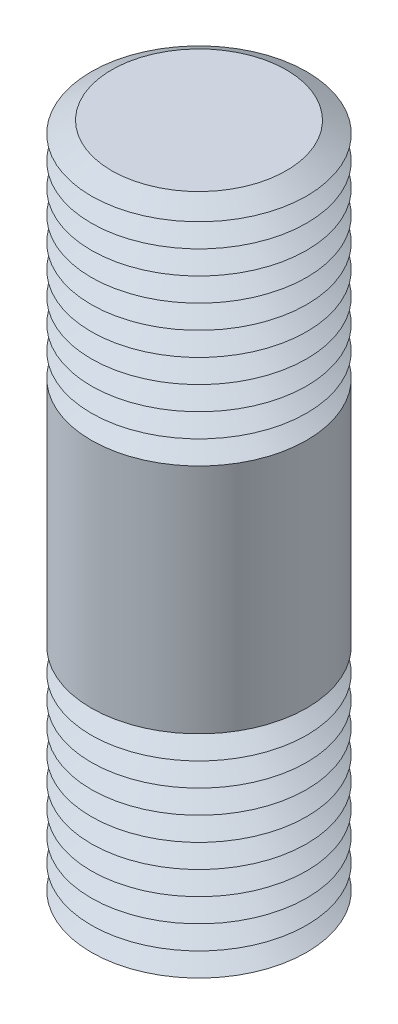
from build123d import *


with BuildPart() as part:
    # Sketch 4 → Revolve 1 (revolve)
    with BuildSketch(Plane.XY, mode=Mode.PRIVATE) as revolve_1_sk:
        Polygon((0, 0), (0, 20), (5.15, 20), (6.35, 19.307179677), (5.15, 18.614359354), (6.35, 17.921539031), (5.15, 17.228718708), (6.35, 16.535898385), (5.15, 15.843078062), (6.35, 15.150257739), (5.15, 14.457437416), (6.35, 13.764617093), (5.15, 13.07179677), (6.35, 12.378976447), (5.15, 11.686156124), (6.35, 10.993335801), (5.15, 10.300515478), (6.35, 9.607695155), (5.15, 8.914874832), (6.35, 8.222054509), (5.15, 7.529234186), (6.35, 6.836413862), (6.35, 0), align=None)
    revolve_1 = revolve(revolve_1_sk.sketch.rotate(Axis((0, -2.968452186, 0), (0, 1, 0)), 90), axis=Axis((0, -2.968452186, 0), (0, 1, 0)))

    # Mirror 1: Revolve 1 across plane
    add(revolve_1.mirror(Plane.ZX))


solid = part.part
